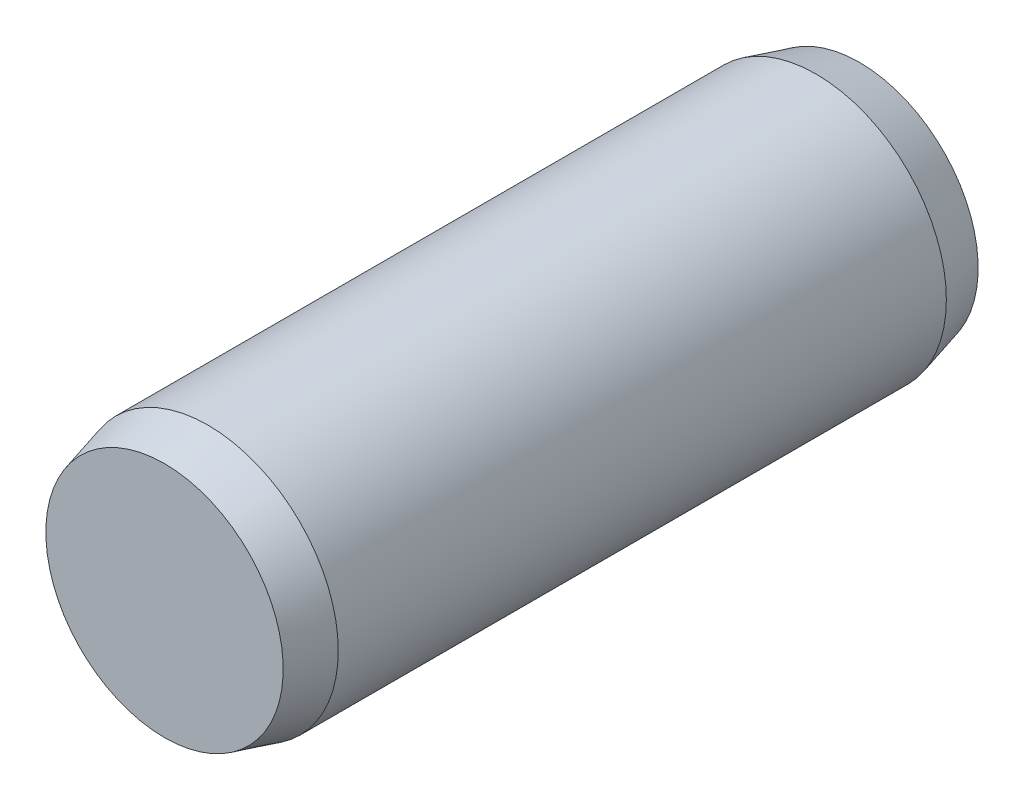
ISO-10303-21;
HEADER;
FILE_DESCRIPTION(('STEP AP214'),'2;1');
FILE_NAME('part.step','',(''),(''),'','','');
FILE_SCHEMA(('AUTOMOTIVE_DESIGN { 1 0 10303 214 1 1 1 1 }'));
ENDSEC;
DATA;
#1=APPLICATION_CONTEXT('core data for automotive mechanical design processes');
#2=APPLICATION_PROTOCOL_DEFINITION('international standard','automotive_design',2000,#1);
#3=PRODUCT_CONTEXT('',#1,'mechanical');
#4=PRODUCT('Part','Part','',(#3));
#5=PRODUCT_RELATED_PRODUCT_CATEGORY('part','',(#4));
#6=PRODUCT_DEFINITION_FORMATION('','',#4);
#7=PRODUCT_DEFINITION_CONTEXT('part definition',#1,'design');
#8=PRODUCT_DEFINITION('design','',#6,#7);
#9=PRODUCT_DEFINITION_SHAPE('','',#8);
#10=(LENGTH_UNIT() NAMED_UNIT(*) SI_UNIT(.MILLI.,.METRE.));
#11=(NAMED_UNIT(*) PLANE_ANGLE_UNIT() SI_UNIT($,.RADIAN.));
#12=(NAMED_UNIT(*) SI_UNIT($,.STERADIAN.) SOLID_ANGLE_UNIT());
#13=UNCERTAINTY_MEASURE_WITH_UNIT(LENGTH_MEASURE(1.E-05),#10,'distance_accuracy_value','');
#14=(GEOMETRIC_REPRESENTATION_CONTEXT(3) GLOBAL_UNCERTAINTY_ASSIGNED_CONTEXT((#13)) GLOBAL_UNIT_ASSIGNED_CONTEXT((#10,
#11,#12)) REPRESENTATION_CONTEXT('',''));
#15=CARTESIAN_POINT('',(0.,0.,0.));
#16=DIRECTION('',(0.,0.,1.));
#17=DIRECTION('',(1.,0.,0.));
#18=AXIS2_PLACEMENT_3D('',#15,#16,#17);
#19=CARTESIAN_POINT('',(0.,0.,4.));
#20=DIRECTION('',(0.,0.,-1.));
#21=DIRECTION('',(0.,1.,0.));
#22=AXIS2_PLACEMENT_3D('',#19,#20,#21);
#23=PLANE('',#22);
#24=CARTESIAN_POINT('',(0.,0.,3.99999999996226));
#25=DIRECTION('',(0.,0.,-1.));
#26=DIRECTION('',(0.,1.,0.));
#27=AXIS2_PLACEMENT_3D('',#24,#25,#26);
#28=CIRCLE('',#27,1.36602540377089);
#29=CARTESIAN_POINT('',(0.,1.36602540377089,3.99999999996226));
#30=VERTEX_POINT('',#29);
#31=EDGE_CURVE('E17',#30,#30,#28,.T.);
#32=ORIENTED_EDGE('',*,*,#31,.F.);
#33=EDGE_LOOP('',(#32));
#34=FACE_BOUND('',#33,.T.);
#35=ADVANCED_FACE('F14',(#34),#23,.F.);
#36=CARTESIAN_POINT('',(0.,0.,-4.));
#37=DIRECTION('',(0.,0.,-1.));
#38=DIRECTION('',(0.,1.,0.));
#39=AXIS2_PLACEMENT_3D('',#36,#37,#38);
#40=PLANE('',#39);
#41=CARTESIAN_POINT('',(0.,0.,-3.99999999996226));
#42=DIRECTION('',(0.,0.,1.));
#43=DIRECTION('',(0.,-1.,0.));
#44=AXIS2_PLACEMENT_3D('',#41,#42,#43);
#45=CIRCLE('',#44,1.36602540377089);
#46=CARTESIAN_POINT('',(0.,-1.36602540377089,-3.99999999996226));
#47=VERTEX_POINT('',#46);
#48=EDGE_CURVE('E26',#47,#47,#45,.T.);
#49=ORIENTED_EDGE('',*,*,#48,.F.);
#50=EDGE_LOOP('',(#49));
#51=FACE_BOUND('',#50,.T.);
#52=ADVANCED_FACE('F38',(#51),#40,.T.);
#53=CARTESIAN_POINT('',(0.,0.,3.49999999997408));
#54=DIRECTION('',(0.,0.,-1.));
#55=DIRECTION('',(0.,1.,0.));
#56=AXIS2_PLACEMENT_3D('',#53,#54,#55);
#57=CONICAL_SURFACE('',#56,1.49999999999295,0.261799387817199);
#58=ORIENTED_EDGE('',*,*,#31,.T.);
#59=EDGE_LOOP('',(#58));
#60=FACE_BOUND('',#59,.T.);
#61=CARTESIAN_POINT('',(0.,0.,3.49999999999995));
#62=DIRECTION('',(0.,0.,-1.));
#63=DIRECTION('',(0.,1.,0.));
#64=AXIS2_PLACEMENT_3D('',#61,#62,#63);
#65=CIRCLE('',#64,1.5);
#66=CARTESIAN_POINT('',(0.,1.49999999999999,3.49999999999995));
#67=VERTEX_POINT('',#66);
#68=EDGE_CURVE('E21',#67,#67,#65,.T.);
#69=ORIENTED_EDGE('',*,*,#68,.F.);
#70=EDGE_LOOP('',(#69));
#71=FACE_BOUND('',#70,.T.);
#72=ADVANCED_FACE('F34',(#60,#71),#57,.T.);
#73=CARTESIAN_POINT('',(0.,0.,-3.49999999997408));
#74=DIRECTION('',(0.,0.,1.));
#75=DIRECTION('',(0.,-1.,0.));
#76=AXIS2_PLACEMENT_3D('',#73,#74,#75);
#77=CONICAL_SURFACE('',#76,1.49999999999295,0.261799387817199);
#78=CARTESIAN_POINT('',(0.,0.,-3.49999999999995));
#79=DIRECTION('',(0.,0.,-1.));
#80=DIRECTION('',(0.,1.,0.));
#81=AXIS2_PLACEMENT_3D('',#78,#79,#80);
#82=CIRCLE('',#81,1.5);
#83=CARTESIAN_POINT('',(0.,1.49999999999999,-3.49999999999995));
#84=VERTEX_POINT('',#83);
#85=EDGE_CURVE('E10',#84,#84,#82,.F.);
#86=ORIENTED_EDGE('',*,*,#85,.F.);
#87=EDGE_LOOP('',(#86));
#88=FACE_BOUND('',#87,.T.);
#89=ORIENTED_EDGE('',*,*,#48,.T.);
#90=EDGE_LOOP('',(#89));
#91=FACE_BOUND('',#90,.T.);
#92=ADVANCED_FACE('F46',(#88,#91),#77,.T.);
#93=CARTESIAN_POINT('',(0.,0.,4.39999999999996));
#94=DIRECTION('',(0.,0.,-1.));
#95=DIRECTION('',(0.,1.,0.));
#96=AXIS2_PLACEMENT_3D('',#93,#94,#95);
#97=CYLINDRICAL_SURFACE('',#96,1.5);
#98=ORIENTED_EDGE('',*,*,#68,.T.);
#99=EDGE_LOOP('',(#98));
#100=FACE_BOUND('',#99,.T.);
#101=ORIENTED_EDGE('',*,*,#85,.T.);
#102=EDGE_LOOP('',(#101));
#103=FACE_BOUND('',#102,.T.);
#104=ADVANCED_FACE('F44',(#100,#103),#97,.T.);
#105=CLOSED_SHELL('',(#35,#52,#72,#92,#104));
#106=MANIFOLD_SOLID_BREP('B1',#105);
#107=ADVANCED_BREP_SHAPE_REPRESENTATION('',(#18,#106),#14);
#108=SHAPE_DEFINITION_REPRESENTATION(#9,#107);
ENDSEC;
END-ISO-10303-21;
